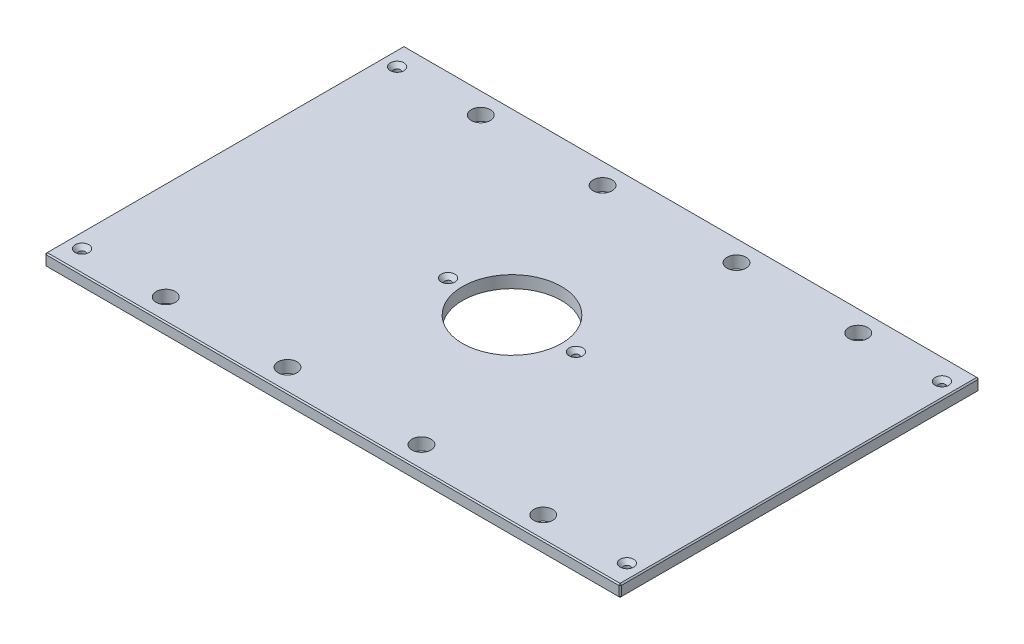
from build123d import *

# Parameters (mm, degrees)
SKETCH1_W                                        = 600.075
SKETCH1_H                                        = 374.65
BOSS_EXTRUDE1_DEPTH                              = 12.7
SKETCH13_R                                       = 51.562
CUT_EXTRUDE6_DEPTH                               = 354.9413045
F_25_32_0_78125_DIAMETER_HOLE1_D                 = 19.84375
CHAMFER2_SIZE                                    = 1.27
CSK_FOR_1_4_FLAT_HEAD_MACHINE_SCREW1_D           = 6.7564
CSK_FOR_1_4_FLAT_HEAD_MACHINE_SCREW1_CSINK_D     = 14.2748
CSK_FOR_1_4_FLAT_HEAD_MACHINE_SCREW1_CSINK_ANGLE = 82


with BuildPart() as part:
    # Sketch1 → Boss-Extrude1 (new body)
    with BuildSketch(Plane(origin=(0, 0, 0), x_dir=(1, 0, 0), z_dir=(0, 1, 0))):
        Rectangle(SKETCH1_W, SKETCH1_H)
    extrude(amount=BOSS_EXTRUDE1_DEPTH)

    # Sketch13 → Cut-Extrude6 (cut, through all)
    with BuildSketch(Plane(origin=(0, 12.7, 0), x_dir=(1, 0, 0), z_dir=(0, 1, 0))):
        with Locations(Location((0, 0, 0), (0, 0, 270))):
            Circle(SKETCH13_R)
    extrude(amount=-CUT_EXTRUDE6_DEPTH, mode=Mode.SUBTRACT)

    # 25_32 _0.78125_ Diameter Hole1 (through all)
    with Locations(Plane(origin=(0, 12.7, 0), x_dir=(1, 0, 0), z_dir=(0, 1, 0))):
        with Locations((196.85, 164.30498), (-196.85, 164.30498), (196.85, -164.30498), (-196.85, -164.30498), (-69.85, 164.30498), (69.85, 164.30498), (69.85, -164.30498), (-69.85, -164.30498)):
            Hole(F_25_32_0_78125_DIAMETER_HOLE1_D / 2)

    # Chamfer2
    chamfer2_edges = [part.edges().sort_by_distance(p)[0] for p in [
        (300.0375, 12.7, 0),
        (0, 12.7, -187.325),
        (-300.0375, 12.7, 0),
        (0, 0, -187.325),
        (300.0375, 0, 0),
        (0, 0, 187.325),
        (-300.0375, 0, 0),
        (0, 12.7, 187.325),
        (-300.0375, 6.35, -187.325),
        (300.0375, 6.35, -187.325),
        (300.0375, 6.35, 187.325),
        (-300.0375, 6.35, 187.325),
    ]]
    chamfer(chamfer2_edges, length=CHAMFER2_SIZE)

    # CSK for 1_4 Flat Head Machine Screw1 (through all)
    with Locations(Plane(origin=(0, 12.7, 0), x_dir=(1, 0, 0), z_dir=(0, 1, 0))):
        with Locations((284.1625, 164.30498), (284.1625, -164.30498), (-284.1625, -164.30498), (-66.675, 0), (66.675, 0), (-284.1625, 164.30498), (-196.85, 164.30498), (-196.85, -164.30498)):
            CounterSinkHole(CSK_FOR_1_4_FLAT_HEAD_MACHINE_SCREW1_D / 2, CSK_FOR_1_4_FLAT_HEAD_MACHINE_SCREW1_CSINK_D / 2, counter_sink_angle=CSK_FOR_1_4_FLAT_HEAD_MACHINE_SCREW1_CSINK_ANGLE)


solid = part.part
